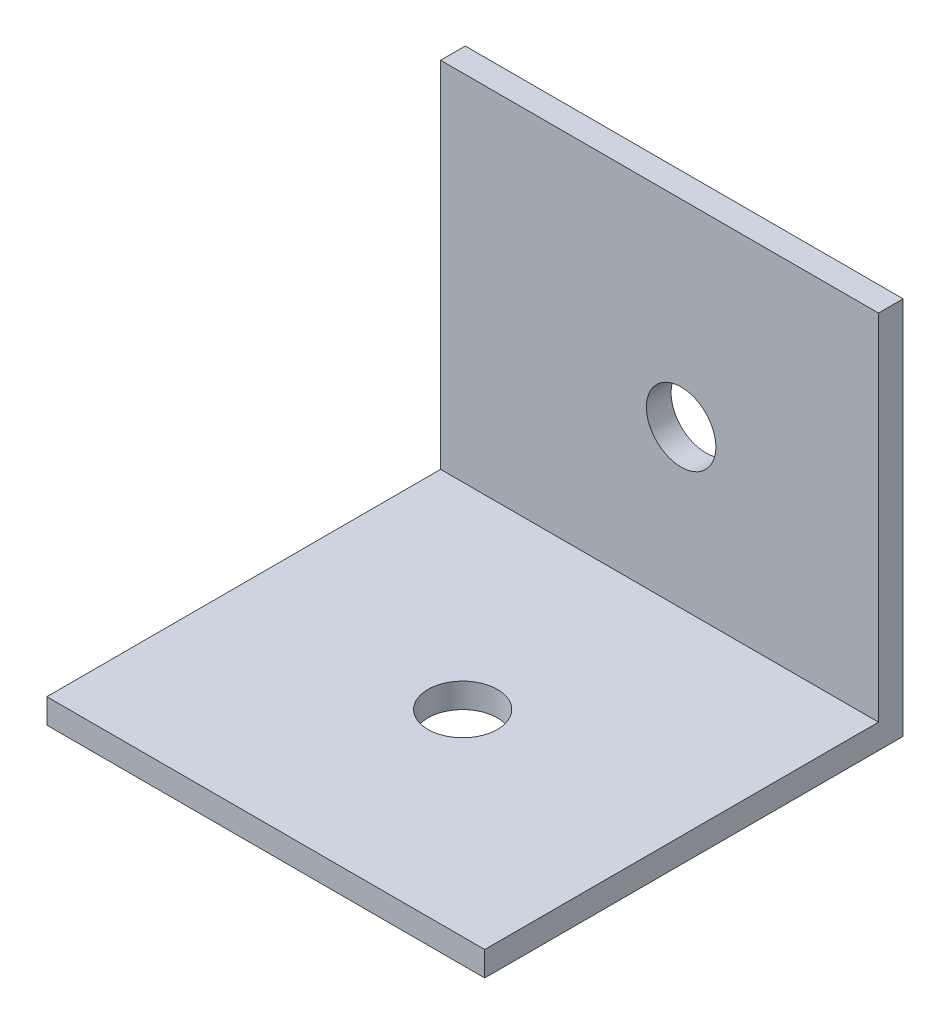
ISO-10303-21;
HEADER;
FILE_DESCRIPTION(('STEP AP214'),'2;1');
FILE_NAME('part.step','',(''),(''),'','','');
FILE_SCHEMA(('AUTOMOTIVE_DESIGN { 1 0 10303 214 1 1 1 1 }'));
ENDSEC;
DATA;
#1=APPLICATION_CONTEXT('core data for automotive mechanical design processes');
#2=APPLICATION_PROTOCOL_DEFINITION('international standard','automotive_design',2000,#1);
#3=PRODUCT_CONTEXT('',#1,'mechanical');
#4=PRODUCT('Part','Part','',(#3));
#5=PRODUCT_RELATED_PRODUCT_CATEGORY('part','',(#4));
#6=PRODUCT_DEFINITION_FORMATION('','',#4);
#7=PRODUCT_DEFINITION_CONTEXT('part definition',#1,'design');
#8=PRODUCT_DEFINITION('design','',#6,#7);
#9=PRODUCT_DEFINITION_SHAPE('','',#8);
#10=(LENGTH_UNIT() NAMED_UNIT(*) SI_UNIT(.MILLI.,.METRE.));
#11=(NAMED_UNIT(*) PLANE_ANGLE_UNIT() SI_UNIT($,.RADIAN.));
#12=(NAMED_UNIT(*) SI_UNIT($,.STERADIAN.) SOLID_ANGLE_UNIT());
#13=UNCERTAINTY_MEASURE_WITH_UNIT(LENGTH_MEASURE(1.E-05),#10,'distance_accuracy_value','');
#14=(GEOMETRIC_REPRESENTATION_CONTEXT(3) GLOBAL_UNCERTAINTY_ASSIGNED_CONTEXT((#13)) GLOBAL_UNIT_ASSIGNED_CONTEXT((#10,
#11,#12)) REPRESENTATION_CONTEXT('',''));
#15=CARTESIAN_POINT('',(0.,0.,0.));
#16=DIRECTION('',(0.,0.,1.));
#17=DIRECTION('',(1.,0.,0.));
#18=AXIS2_PLACEMENT_3D('',#15,#16,#17);
#19=CARTESIAN_POINT('',(0.,0.,26.924));
#20=DIRECTION('',(0.,0.,1.));
#21=DIRECTION('',(1.,0.,0.));
#22=AXIS2_PLACEMENT_3D('',#19,#20,#21);
#23=PLANE('',#22);
#24=DIRECTION('',(0.,1.,0.));
#25=VECTOR('',#24,1.);
#26=CARTESIAN_POINT('',(168.399278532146,0.,26.924));
#27=LINE('',#26,#25);
#28=CARTESIAN_POINT('',(168.399278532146,43.4545093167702,26.924));
#29=VERTEX_POINT('',#28);
#30=CARTESIAN_POINT('',(168.399278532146,45.0420093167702,26.924));
#31=VERTEX_POINT('',#30);
#32=EDGE_CURVE('E52',#29,#31,#27,.T.);
#33=ORIENTED_EDGE('',*,*,#32,.F.);
#34=DIRECTION('',(1.,0.,0.));
#35=VECTOR('',#34,1.);
#36=CARTESIAN_POINT('',(-209.826086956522,43.4545093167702,26.924));
#37=LINE('',#36,#35);
#38=CARTESIAN_POINT('',(196.573913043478,43.4545093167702,26.924));
#39=VERTEX_POINT('',#38);
#40=EDGE_CURVE('E59',#29,#39,#37,.T.);
#41=ORIENTED_EDGE('',*,*,#40,.T.);
#42=DIRECTION('',(0.,1.,0.));
#43=VECTOR('',#42,1.);
#44=CARTESIAN_POINT('',(196.573913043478,67.8385093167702,26.924));
#45=LINE('',#44,#43);
#46=CARTESIAN_POINT('',(196.573913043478,45.0420093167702,26.924));
#47=VERTEX_POINT('',#46);
#48=EDGE_CURVE('E126',#39,#47,#45,.T.);
#49=ORIENTED_EDGE('',*,*,#48,.T.);
#50=DIRECTION('',(1.,0.,0.));
#51=VECTOR('',#50,1.);
#52=CARTESIAN_POINT('',(-209.826086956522,45.0420093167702,26.924));
#53=LINE('',#52,#51);
#54=EDGE_CURVE('E86',#31,#47,#53,.T.);
#55=ORIENTED_EDGE('',*,*,#54,.F.);
#56=EDGE_LOOP('',(#33,#41,#49,#55));
#57=FACE_BOUND('',#56,.T.);
#58=ADVANCED_FACE('F37',(#57),#23,.T.);
#59=CARTESIAN_POINT('',(-209.826086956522,43.4545093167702,26.924));
#60=DIRECTION('',(0.,1.,0.));
#61=DIRECTION('',(0.,0.,1.));
#62=AXIS2_PLACEMENT_3D('',#59,#60,#61);
#63=PLANE('',#62);
#64=CARTESIAN_POINT('',(182.486595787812,43.4545093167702,14.25575));
#65=DIRECTION('',(0.,1.,0.));
#66=DIRECTION('',(0.,0.,1.));
#67=AXIS2_PLACEMENT_3D('',#64,#65,#66);
#68=CIRCLE('',#67,2.23393);
#69=CARTESIAN_POINT('',(182.486595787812,43.4545093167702,16.48968));
#70=VERTEX_POINT('',#69);
#71=EDGE_CURVE('E114',#70,#70,#68,.T.);
#72=ORIENTED_EDGE('',*,*,#71,.T.);
#73=EDGE_LOOP('',(#72));
#74=FACE_BOUND('',#73,.T.);
#75=ORIENTED_EDGE('',*,*,#40,.F.);
#76=DIRECTION('',(0.,0.,1.));
#77=VECTOR('',#76,1.);
#78=CARTESIAN_POINT('',(168.399278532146,43.4545093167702,79.0454226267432));
#79=LINE('',#78,#77);
#80=CARTESIAN_POINT('',(168.399278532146,43.4545093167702,0.));
#81=VERTEX_POINT('',#80);
#82=EDGE_CURVE('E105',#81,#29,#79,.T.);
#83=ORIENTED_EDGE('',*,*,#82,.F.);
#84=DIRECTION('',(1.,0.,0.));
#85=VECTOR('',#84,1.);
#86=CARTESIAN_POINT('',(-209.826086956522,43.4545093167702,0.));
#87=LINE('',#86,#85);
#88=CARTESIAN_POINT('',(196.573913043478,43.4545093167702,0.));
#89=VERTEX_POINT('',#88);
#90=EDGE_CURVE('E71',#81,#89,#87,.T.);
#91=ORIENTED_EDGE('',*,*,#90,.T.);
#92=DIRECTION('',(0.,0.,-1.));
#93=VECTOR('',#92,1.);
#94=CARTESIAN_POINT('',(196.573913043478,43.4545093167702,26.924));
#95=LINE('',#94,#93);
#96=EDGE_CURVE('E45',#39,#89,#95,.T.);
#97=ORIENTED_EDGE('',*,*,#96,.F.);
#98=EDGE_LOOP('',(#75,#83,#91,#97));
#99=FACE_BOUND('',#98,.T.);
#100=ADVANCED_FACE('F39',(#74,#99),#63,.F.);
#101=CARTESIAN_POINT('',(196.573913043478,67.8385093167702,26.924));
#102=DIRECTION('',(-1.,0.,0.));
#103=DIRECTION('',(0.,0.,1.));
#104=AXIS2_PLACEMENT_3D('',#101,#102,#103);
#105=PLANE('',#104);
#106=DIRECTION('',(0.,1.,0.));
#107=VECTOR('',#106,1.);
#108=CARTESIAN_POINT('',(196.573913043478,55.1385093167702,1.5875));
#109=LINE('',#108,#107);
#110=CARTESIAN_POINT('',(196.573913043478,45.0420093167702,1.58750000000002));
#111=VERTEX_POINT('',#110);
#112=CARTESIAN_POINT('',(196.573913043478,67.8385093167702,1.5875));
#113=VERTEX_POINT('',#112);
#114=EDGE_CURVE('E79',#111,#113,#109,.T.);
#115=ORIENTED_EDGE('',*,*,#114,.F.);
#116=DIRECTION('',(0.,0.,1.));
#117=VECTOR('',#116,1.);
#118=CARTESIAN_POINT('',(196.573913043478,45.0420093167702,-404.93789811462));
#119=LINE('',#118,#117);
#120=EDGE_CURVE('E145',#111,#47,#119,.T.);
#121=ORIENTED_EDGE('',*,*,#120,.T.);
#122=ORIENTED_EDGE('',*,*,#48,.F.);
#123=ORIENTED_EDGE('',*,*,#96,.T.);
#124=DIRECTION('',(0.,1.,0.));
#125=VECTOR('',#124,1.);
#126=CARTESIAN_POINT('',(196.573913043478,67.8385093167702,0.));
#127=LINE('',#126,#125);
#128=CARTESIAN_POINT('',(196.573913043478,67.8385093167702,0.));
#129=VERTEX_POINT('',#128);
#130=EDGE_CURVE('E119',#89,#129,#127,.T.);
#131=ORIENTED_EDGE('',*,*,#130,.T.);
#132=DIRECTION('',(0.,0.,-1.));
#133=VECTOR('',#132,1.);
#134=CARTESIAN_POINT('',(196.573913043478,67.8385093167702,26.924));
#135=LINE('',#134,#133);
#136=EDGE_CURVE('E130',#113,#129,#135,.T.);
#137=ORIENTED_EDGE('',*,*,#136,.F.);
#138=EDGE_LOOP('',(#115,#121,#122,#123,#131,#137));
#139=FACE_BOUND('',#138,.T.);
#140=ADVANCED_FACE('F149',(#139),#105,.F.);
#141=CARTESIAN_POINT('',(-209.826086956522,67.8385093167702,26.924));
#142=DIRECTION('',(0.,-1.,0.));
#143=DIRECTION('',(0.,0.,-1.));
#144=AXIS2_PLACEMENT_3D('',#141,#142,#143);
#145=PLANE('',#144);
#146=DIRECTION('',(-1.,0.,0.));
#147=VECTOR('',#146,1.);
#148=CARTESIAN_POINT('',(-209.826086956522,67.8385093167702,0.));
#149=LINE('',#148,#147);
#150=CARTESIAN_POINT('',(168.399278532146,67.8385093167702,0.));
#151=VERTEX_POINT('',#150);
#152=EDGE_CURVE('E121',#129,#151,#149,.T.);
#153=ORIENTED_EDGE('',*,*,#152,.T.);
#154=DIRECTION('',(0.,0.,1.));
#155=VECTOR('',#154,1.);
#156=CARTESIAN_POINT('',(168.399278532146,67.8385093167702,26.9240000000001));
#157=LINE('',#156,#155);
#158=CARTESIAN_POINT('',(168.399278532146,67.8385093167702,1.5875));
#159=VERTEX_POINT('',#158);
#160=EDGE_CURVE('E107',#151,#159,#157,.T.);
#161=ORIENTED_EDGE('',*,*,#160,.T.);
#162=DIRECTION('',(-1.,0.,0.));
#163=VECTOR('',#162,1.);
#164=CARTESIAN_POINT('',(-209.826086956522,67.8385093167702,1.5875));
#165=LINE('',#164,#163);
#166=EDGE_CURVE('E123',#113,#159,#165,.T.);
#167=ORIENTED_EDGE('',*,*,#166,.F.);
#168=ORIENTED_EDGE('',*,*,#136,.T.);
#169=EDGE_LOOP('',(#153,#161,#167,#168));
#170=FACE_BOUND('',#169,.T.);
#171=ADVANCED_FACE('F185',(#170),#145,.F.);
#172=CARTESIAN_POINT('',(0.,0.,0.));
#173=DIRECTION('',(0.,0.,1.));
#174=DIRECTION('',(1.,0.,0.));
#175=AXIS2_PLACEMENT_3D('',#172,#173,#174);
#176=PLANE('',#175);
#177=CARTESIAN_POINT('',(183.873913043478,55.1385093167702,0.));
#178=DIRECTION('',(0.,0.,-1.));
#179=DIRECTION('',(-1.,0.,0.));
#180=AXIS2_PLACEMENT_3D('',#177,#178,#179);
#181=CIRCLE('',#180,2.23393);
#182=CARTESIAN_POINT('',(181.639983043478,55.1385093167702,0.));
#183=VERTEX_POINT('',#182);
#184=EDGE_CURVE('E111',#183,#183,#181,.T.);
#185=ORIENTED_EDGE('',*,*,#184,.F.);
#186=EDGE_LOOP('',(#185));
#187=FACE_BOUND('',#186,.T.);
#188=ORIENTED_EDGE('',*,*,#90,.F.);
#189=DIRECTION('',(0.,1.,0.));
#190=VECTOR('',#189,1.);
#191=CARTESIAN_POINT('',(168.399278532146,0.,0.));
#192=LINE('',#191,#190);
#193=EDGE_CURVE('E103',#81,#151,#192,.T.);
#194=ORIENTED_EDGE('',*,*,#193,.T.);
#195=ORIENTED_EDGE('',*,*,#152,.F.);
#196=ORIENTED_EDGE('',*,*,#130,.F.);
#197=EDGE_LOOP('',(#188,#194,#195,#196));
#198=FACE_BOUND('',#197,.T.);
#199=ADVANCED_FACE('F117',(#187,#198),#176,.F.);
#200=CARTESIAN_POINT('',(-209.826086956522,55.1385093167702,1.5875));
#201=DIRECTION('',(0.,0.,-1.));
#202=DIRECTION('',(-1.,0.,0.));
#203=AXIS2_PLACEMENT_3D('',#200,#201,#202);
#204=PLANE('',#203);
#205=CARTESIAN_POINT('',(183.873913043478,55.1385093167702,1.5875));
#206=DIRECTION('',(0.,0.,-1.));
#207=DIRECTION('',(-1.,0.,0.));
#208=AXIS2_PLACEMENT_3D('',#205,#206,#207);
#209=CIRCLE('',#208,2.23393);
#210=CARTESIAN_POINT('',(181.639983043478,55.1385093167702,1.5875));
#211=VERTEX_POINT('',#210);
#212=EDGE_CURVE('E132',#211,#211,#209,.T.);
#213=ORIENTED_EDGE('',*,*,#212,.T.);
#214=EDGE_LOOP('',(#213));
#215=FACE_BOUND('',#214,.T.);
#216=ORIENTED_EDGE('',*,*,#166,.T.);
#217=DIRECTION('',(0.,-1.,0.));
#218=VECTOR('',#217,1.);
#219=CARTESIAN_POINT('',(168.399278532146,55.1385093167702,1.5875));
#220=LINE('',#219,#218);
#221=CARTESIAN_POINT('',(168.399278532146,45.0420093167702,1.58750000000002));
#222=VERTEX_POINT('',#221);
#223=EDGE_CURVE('E113',#159,#222,#220,.T.);
#224=ORIENTED_EDGE('',*,*,#223,.T.);
#225=DIRECTION('',(1.,0.,0.));
#226=VECTOR('',#225,1.);
#227=CARTESIAN_POINT('',(-209.826086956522,45.0420093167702,1.58750000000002));
#228=LINE('',#227,#226);
#229=EDGE_CURVE('E136',#222,#111,#228,.T.);
#230=ORIENTED_EDGE('',*,*,#229,.T.);
#231=ORIENTED_EDGE('',*,*,#114,.T.);
#232=EDGE_LOOP('',(#216,#224,#230,#231));
#233=FACE_BOUND('',#232,.T.);
#234=ADVANCED_FACE('F154',(#215,#233),#204,.F.);
#235=CARTESIAN_POINT('',(-209.826086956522,45.0420093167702,-404.93789811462));
#236=DIRECTION('',(0.,-1.,0.));
#237=DIRECTION('',(0.,0.,-1.));
#238=AXIS2_PLACEMENT_3D('',#235,#236,#237);
#239=PLANE('',#238);
#240=CARTESIAN_POINT('',(182.486595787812,45.0420093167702,14.25575));
#241=DIRECTION('',(0.,1.,0.));
#242=DIRECTION('',(0.,0.,1.));
#243=AXIS2_PLACEMENT_3D('',#240,#241,#242);
#244=CIRCLE('',#243,2.23393);
#245=CARTESIAN_POINT('',(182.486595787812,45.0420093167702,16.48968));
#246=VERTEX_POINT('',#245);
#247=EDGE_CURVE('E160',#246,#246,#244,.T.);
#248=ORIENTED_EDGE('',*,*,#247,.F.);
#249=EDGE_LOOP('',(#248));
#250=FACE_BOUND('',#249,.T.);
#251=ORIENTED_EDGE('',*,*,#229,.F.);
#252=DIRECTION('',(0.,0.,1.));
#253=VECTOR('',#252,1.);
#254=CARTESIAN_POINT('',(168.399278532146,45.0420093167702,-404.93789811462));
#255=LINE('',#254,#253);
#256=EDGE_CURVE('E11',#222,#31,#255,.T.);
#257=ORIENTED_EDGE('',*,*,#256,.T.);
#258=ORIENTED_EDGE('',*,*,#54,.T.);
#259=ORIENTED_EDGE('',*,*,#120,.F.);
#260=EDGE_LOOP('',(#251,#257,#258,#259));
#261=FACE_BOUND('',#260,.T.);
#262=ADVANCED_FACE('F152',(#250,#261),#239,.F.);
#263=CARTESIAN_POINT('',(183.873913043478,55.1385093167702,2.54));
#264=DIRECTION('',(0.,0.,-1.));
#265=DIRECTION('',(-1.,0.,0.));
#266=AXIS2_PLACEMENT_3D('',#263,#264,#265);
#267=CYLINDRICAL_SURFACE('',#266,2.23393);
#268=ORIENTED_EDGE('',*,*,#184,.T.);
#269=EDGE_LOOP('',(#268));
#270=FACE_BOUND('',#269,.T.);
#271=ORIENTED_EDGE('',*,*,#212,.F.);
#272=EDGE_LOOP('',(#271));
#273=FACE_BOUND('',#272,.T.);
#274=ADVANCED_FACE('F168',(#270,#273),#267,.F.);
#275=CARTESIAN_POINT('',(168.399278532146,108.47850931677,79.0454226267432));
#276=DIRECTION('',(1.,0.,0.));
#277=DIRECTION('',(0.,0.,-1.));
#278=AXIS2_PLACEMENT_3D('',#275,#276,#277);
#279=PLANE('',#278);
#280=ORIENTED_EDGE('',*,*,#82,.T.);
#281=ORIENTED_EDGE('',*,*,#32,.T.);
#282=ORIENTED_EDGE('',*,*,#256,.F.);
#283=ORIENTED_EDGE('',*,*,#223,.F.);
#284=ORIENTED_EDGE('',*,*,#160,.F.);
#285=ORIENTED_EDGE('',*,*,#193,.F.);
#286=EDGE_LOOP('',(#280,#281,#282,#283,#284,#285));
#287=FACE_BOUND('',#286,.T.);
#288=ADVANCED_FACE('F104',(#287),#279,.F.);
#289=CARTESIAN_POINT('',(182.486595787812,42.5020093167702,14.25575));
#290=DIRECTION('',(0.,1.,0.));
#291=DIRECTION('',(0.,0.,1.));
#292=AXIS2_PLACEMENT_3D('',#289,#290,#291);
#293=CYLINDRICAL_SURFACE('',#292,2.23393);
#294=ORIENTED_EDGE('',*,*,#247,.T.);
#295=EDGE_LOOP('',(#294));
#296=FACE_BOUND('',#295,.T.);
#297=ORIENTED_EDGE('',*,*,#71,.F.);
#298=EDGE_LOOP('',(#297));
#299=FACE_BOUND('',#298,.T.);
#300=ADVANCED_FACE('F164',(#296,#299),#293,.F.);
#301=CLOSED_SHELL('',(#58,#100,#140,#171,#199,#234,#262,#274,#288,#300));
#302=MANIFOLD_SOLID_BREP('B2',#301);
#303=ADVANCED_BREP_SHAPE_REPRESENTATION('',(#18,#302),#14);
#304=SHAPE_DEFINITION_REPRESENTATION(#9,#303);
ENDSEC;
END-ISO-10303-21;
